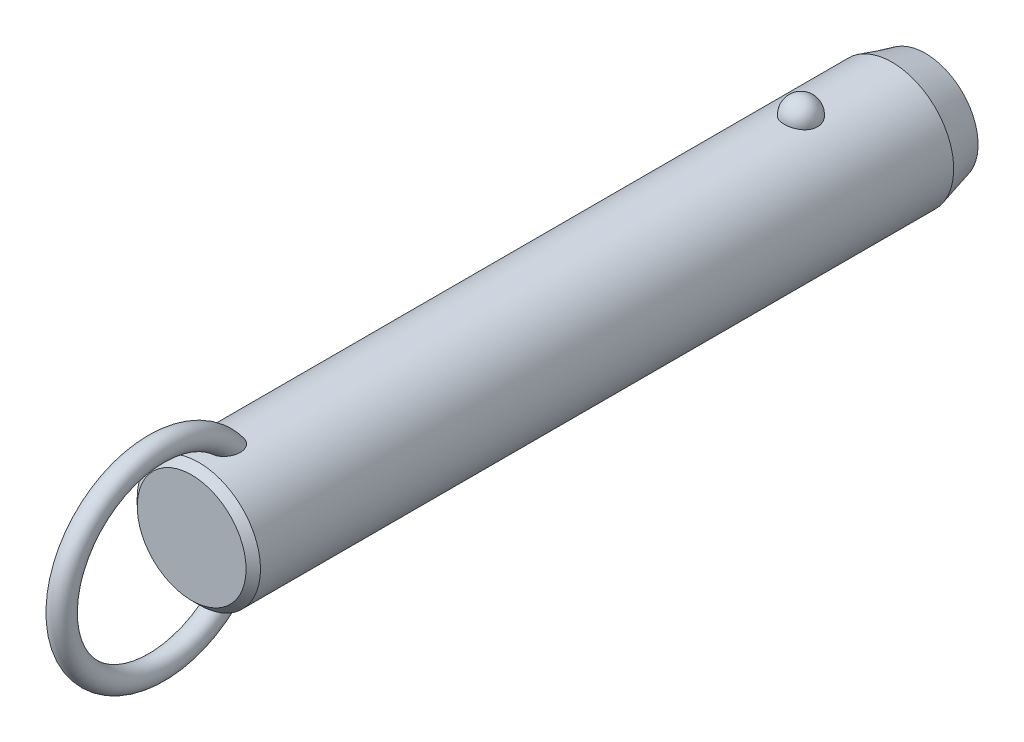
ISO-10303-21;
HEADER;
FILE_DESCRIPTION(('STEP AP214'),'2;1');
FILE_NAME('part.step','',(''),(''),'','','');
FILE_SCHEMA(('AUTOMOTIVE_DESIGN { 1 0 10303 214 1 1 1 1 }'));
ENDSEC;
DATA;
#1=APPLICATION_CONTEXT('core data for automotive mechanical design processes');
#2=APPLICATION_PROTOCOL_DEFINITION('international standard','automotive_design',2000,#1);
#3=PRODUCT_CONTEXT('',#1,'mechanical');
#4=PRODUCT('Part','Part','',(#3));
#5=PRODUCT_RELATED_PRODUCT_CATEGORY('part','',(#4));
#6=PRODUCT_DEFINITION_FORMATION('','',#4);
#7=PRODUCT_DEFINITION_CONTEXT('part definition',#1,'design');
#8=PRODUCT_DEFINITION('design','',#6,#7);
#9=PRODUCT_DEFINITION_SHAPE('','',#8);
#10=(LENGTH_UNIT() NAMED_UNIT(*) SI_UNIT(.MILLI.,.METRE.));
#11=(NAMED_UNIT(*) PLANE_ANGLE_UNIT() SI_UNIT($,.RADIAN.));
#12=(NAMED_UNIT(*) SI_UNIT($,.STERADIAN.) SOLID_ANGLE_UNIT());
#13=UNCERTAINTY_MEASURE_WITH_UNIT(LENGTH_MEASURE(1.E-05),#10,'distance_accuracy_value','');
#14=(GEOMETRIC_REPRESENTATION_CONTEXT(3) GLOBAL_UNCERTAINTY_ASSIGNED_CONTEXT((#13)) GLOBAL_UNIT_ASSIGNED_CONTEXT((#10,
#11,#12)) REPRESENTATION_CONTEXT('',''));
#15=CARTESIAN_POINT('',(0.,0.,0.));
#16=DIRECTION('',(0.,0.,1.));
#17=DIRECTION('',(1.,0.,0.));
#18=AXIS2_PLACEMENT_3D('',#15,#16,#17);
#19=CARTESIAN_POINT('',(0.,0.,94.));
#20=DIRECTION('',(0.,0.,-1.));
#21=DIRECTION('',(-1.,0.,0.));
#22=AXIS2_PLACEMENT_3D('',#19,#20,#21);
#23=CYLINDRICAL_SURFACE('',#22,11.1);
#24=CARTESIAN_POINT('',(2.9724815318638,10.6945945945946,-3.));
#25=CARTESIAN_POINT('',(2.97247830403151,10.6945972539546,-2.83225059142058));
#26=CARTESIAN_POINT('',(2.95876598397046,10.6984356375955,-2.66445972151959));
#27=CARTESIAN_POINT('',(2.90424529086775,10.7133624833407,-2.33362381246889));
#28=CARTESIAN_POINT('',(2.8634252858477,10.7244540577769,-2.1705808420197));
#29=CARTESIAN_POINT('',(2.75573657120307,10.7526272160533,-1.85396767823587));
#30=CARTESIAN_POINT('',(2.68887937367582,10.7697061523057,-1.70039333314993));
#31=CARTESIAN_POINT('',(2.53079696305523,10.8079438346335,-1.40691598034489));
#32=CARTESIAN_POINT('',(2.43957264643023,10.8291024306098,-1.2670124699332));
#33=CARTESIAN_POINT('',(2.23458150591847,10.8732541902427,-1.00409565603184));
#34=CARTESIAN_POINT('',(2.12071295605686,10.8962553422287,-0.881162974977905));
#35=CARTESIAN_POINT('',(1.87365402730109,10.9414421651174,-0.656352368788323));
#36=CARTESIAN_POINT('',(1.74046358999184,10.9636278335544,-0.554474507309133));
#37=CARTESIAN_POINT('',(1.45872188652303,11.0046495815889,-0.374872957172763));
#38=CARTESIAN_POINT('',(1.31021276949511,11.0234944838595,-0.297085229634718));
#39=CARTESIAN_POINT('',(1.00170030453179,11.0557957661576,-0.167529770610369));
#40=CARTESIAN_POINT('',(0.841698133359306,11.0692526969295,-0.115759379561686));
#41=CARTESIAN_POINT('',(0.517607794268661,11.0890932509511,-0.0403925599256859));
#42=CARTESIAN_POINT('',(0.353633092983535,11.0955916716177,-0.0163383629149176));
#43=CARTESIAN_POINT('',(0.0238420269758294,11.1011989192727,0.0044517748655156));
#44=CARTESIAN_POINT('',(-0.141974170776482,11.1003084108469,0.00119017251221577));
#45=CARTESIAN_POINT('',(-0.468405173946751,11.0912990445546,-0.0323233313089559));
#46=CARTESIAN_POINT('',(-0.629059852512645,11.0832767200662,-0.0622147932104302));
#47=CARTESIAN_POINT('',(-0.942937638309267,11.0609962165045,-0.147645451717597));
#48=CARTESIAN_POINT('',(-1.09616062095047,11.0467379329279,-0.203185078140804));
#49=CARTESIAN_POINT('',(-1.39181061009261,11.0134071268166,-0.3387529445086));
#50=CARTESIAN_POINT('',(-1.53417383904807,10.9943086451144,-0.418913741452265));
#51=CARTESIAN_POINT('',(-1.80342160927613,10.9533667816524,-0.60144882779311));
#52=CARTESIAN_POINT('',(-1.9303046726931,10.9315231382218,-0.703825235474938));
#53=CARTESIAN_POINT('',(-2.16747598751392,10.887005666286,-0.930091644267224));
#54=CARTESIAN_POINT('',(-2.27742774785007,10.8643239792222,-1.05433291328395));
#55=CARTESIAN_POINT('',(-2.47517316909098,10.8209886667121,-1.31966633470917));
#56=CARTESIAN_POINT('',(-2.56296538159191,10.8003351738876,-1.46075958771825));
#57=CARTESIAN_POINT('',(-2.71500300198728,10.7631304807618,-1.75753646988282));
#58=CARTESIAN_POINT('',(-2.77898901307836,10.7466250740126,-1.91335887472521));
#59=CARTESIAN_POINT('',(-2.88046189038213,10.7198747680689,-2.2339152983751));
#60=CARTESIAN_POINT('',(-2.91794947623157,10.709629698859,-2.39864907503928));
#61=CARTESIAN_POINT('',(-2.96537819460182,10.6965949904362,-2.73165170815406));
#62=CARTESIAN_POINT('',(-2.97542891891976,10.693775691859,-2.89990378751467));
#63=CARTESIAN_POINT('',(-2.96804271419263,10.6958279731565,-3.235752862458));
#64=CARTESIAN_POINT('',(-2.95060646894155,10.7006993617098,-3.40334987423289));
#65=CARTESIAN_POINT('',(-2.88883358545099,10.71753912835,-3.73233906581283));
#66=CARTESIAN_POINT('',(-2.84462026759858,10.7294749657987,-3.89375610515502));
#67=CARTESIAN_POINT('',(-2.73050447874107,10.7590797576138,-4.20667949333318));
#68=CARTESIAN_POINT('',(-2.66060103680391,10.7767489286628,-4.35818546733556));
#69=CARTESIAN_POINT('',(-2.49642559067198,10.8159599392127,-4.6478542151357));
#70=CARTESIAN_POINT('',(-2.40203047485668,10.8375211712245,-4.78594458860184));
#71=CARTESIAN_POINT('',(-2.19143488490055,10.8820570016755,-5.0441038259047));
#72=CARTESIAN_POINT('',(-2.07523364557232,10.9050316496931,-5.16417205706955));
#73=CARTESIAN_POINT('',(-1.82361254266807,10.9499219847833,-5.38334833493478));
#74=CARTESIAN_POINT('',(-1.68812945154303,10.9718338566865,-5.48238464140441));
#75=CARTESIAN_POINT('',(-1.40191298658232,11.0120611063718,-5.65618873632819));
#76=CARTESIAN_POINT('',(-1.25118062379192,11.0303767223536,-5.73095813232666));
#77=CARTESIAN_POINT('',(-0.940570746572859,11.0611653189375,-5.85334725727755));
#78=CARTESIAN_POINT('',(-0.780821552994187,11.0737044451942,-5.90127578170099));
#79=CARTESIAN_POINT('',(-0.455204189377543,11.0918598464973,-5.96992976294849));
#80=CARTESIAN_POINT('',(-0.289336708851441,11.0974768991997,-5.99065827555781));
#81=CARTESIAN_POINT('',(0.0406846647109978,11.1011307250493,-6.00418773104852));
#82=CARTESIAN_POINT('',(0.204817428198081,11.099299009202,-5.99747318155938));
#83=CARTESIAN_POINT('',(0.5295530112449,11.088551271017,-5.9574031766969));
#84=CARTESIAN_POINT('',(0.69015594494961,11.0796354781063,-5.92404858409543));
#85=CARTESIAN_POINT('',(1.0027760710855,11.0557204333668,-5.83180084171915));
#86=CARTESIAN_POINT('',(1.15482001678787,11.0407414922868,-5.77299291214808));
#87=CARTESIAN_POINT('',(1.44678373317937,11.0062913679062,-5.63147366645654));
#88=CARTESIAN_POINT('',(1.58670279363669,10.9868199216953,-5.54876095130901));
#89=CARTESIAN_POINT('',(1.8527023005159,10.9451315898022,-5.36027644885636));
#90=CARTESIAN_POINT('',(1.97855158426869,10.9228788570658,-5.25418644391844));
#91=CARTESIAN_POINT('',(2.21080872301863,10.8782509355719,-5.02251354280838));
#92=CARTESIAN_POINT('',(2.31721312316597,10.8558757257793,-4.89692718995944));
#93=CARTESIAN_POINT('',(2.5094551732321,10.8130715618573,-4.62745408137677));
#94=CARTESIAN_POINT('',(2.59493284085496,10.7926798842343,-4.48330448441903));
#95=CARTESIAN_POINT('',(2.740862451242,10.7565495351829,-4.18236358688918));
#96=CARTESIAN_POINT('',(2.80132490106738,10.7408089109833,-4.02557762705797));
#97=CARTESIAN_POINT('',(2.88959070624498,10.7173718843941,-3.72475308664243));
#98=CARTESIAN_POINT('',(2.92062102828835,10.7088950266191,-3.58171216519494));
#99=CARTESIAN_POINT('',(2.96206765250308,10.6975052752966,-3.29245795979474));
#100=CARTESIAN_POINT('',(2.97248434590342,10.6945922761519,-3.14624473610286));
#101=CARTESIAN_POINT('',(2.9724815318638,10.6945945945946,-3.));
#102=B_SPLINE_CURVE_WITH_KNOTS('',3,(#24,#25,#26,#27,#28,#29,#30,#31,#32,#33,#34,#35,#36,#37,
#38,#39,#40,#41,#42,#43,#44,#45,#46,#47,#48,#49,#50,#51,#52,#53,#54,#55,#56,#57,#58,#59,#60,#61,
#62,#63,#64,#65,#66,#67,#68,#69,#70,#71,#72,#73,#74,#75,#76,#77,#78,#79,#80,#81,#82,#83,#84,#85,
#86,#87,#88,#89,#90,#91,#92,#93,#94,#95,#96,#97,#98,#99,#100,#101),.UNSPECIFIED.,.T.,.F.,(4,2,2,
2,2,2,2,2,2,2,2,2,2,2,2,2,2,2,2,2,2,2,2,2,2,2,2,2,2,2,2,2,2,2,2,2,2,2,4),(0.,0.502722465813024,
1.00566079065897,1.5083769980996,2.01107471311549,2.51608392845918,3.02109467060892,
3.52475118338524,4.02835620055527,4.523518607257,5.0186364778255,5.50715297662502,
5.9956776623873,6.48688002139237,6.97812923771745,7.47814366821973,7.9781907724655,
8.48353712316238,8.9888697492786,9.49218093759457,9.99547960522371,10.4964777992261,
10.997494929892,11.5010810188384,12.0046847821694,12.5099796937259,13.0152411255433,
13.5145635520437,14.0138298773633,14.5043200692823,14.9947943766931,15.4836390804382,
15.9725123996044,16.4685040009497,16.9645836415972,17.4686765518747,17.972557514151,
18.410841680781,18.849117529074),.UNSPECIFIED.);
#103=CARTESIAN_POINT('',(2.9724815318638,10.6945945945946,-3.));
#104=VERTEX_POINT('',#103);
#105=EDGE_CURVE('E41',#104,#104,#102,.T.);
#106=ORIENTED_EDGE('',*,*,#105,.T.);
#107=EDGE_LOOP('',(#106));
#108=FACE_BOUND('',#107,.T.);
#109=CARTESIAN_POINT('',(0.,0.,105.4));
#110=DIRECTION('',(0.,0.,1.));
#111=DIRECTION('',(1.,0.,0.));
#112=AXIS2_PLACEMENT_3D('',#109,#110,#111);
#113=CIRCLE('',#112,11.1);
#114=CARTESIAN_POINT('',(11.1,0.,105.4));
#115=VERTEX_POINT('',#114);
#116=EDGE_CURVE('E10',#115,#115,#113,.F.);
#117=ORIENTED_EDGE('',*,*,#116,.T.);
#118=EDGE_LOOP('',(#117));
#119=FACE_BOUND('',#118,.T.);
#120=CARTESIAN_POINT('',(-0.564520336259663,-11.0856356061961,97.6578154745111));
#121=CARTESIAN_POINT('',(-0.667202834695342,-11.0804062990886,97.6912839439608));
#122=CARTESIAN_POINT('',(-0.766875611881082,-11.0738877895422,97.7338357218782));
#123=CARTESIAN_POINT('',(-0.957284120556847,-11.0590576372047,97.8354190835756));
#124=CARTESIAN_POINT('',(-1.04801616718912,-11.0507452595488,97.8944574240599));
#125=CARTESIAN_POINT('',(-1.21800952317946,-11.0333016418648,98.0265293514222));
#126=CARTESIAN_POINT('',(-1.29730805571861,-11.0241732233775,98.0995156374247));
#127=CARTESIAN_POINT('',(-1.44337665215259,-11.0060026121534,98.2570374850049));
#128=CARTESIAN_POINT('',(-1.51014622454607,-10.9969604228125,98.3415734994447));
#129=CARTESIAN_POINT('',(-1.63454620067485,-10.9791841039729,98.5255213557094));
#130=CARTESIAN_POINT('',(-1.69127003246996,-10.9705107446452,98.6255493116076));
#131=CARTESIAN_POINT('',(-1.78980785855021,-10.9548648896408,98.8327902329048));
#132=CARTESIAN_POINT('',(-1.83161214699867,-10.9478935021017,98.9400078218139));
#133=CARTESIAN_POINT('',(-1.91557028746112,-10.9335803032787,99.2054080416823));
#134=CARTESIAN_POINT('',(-1.95040620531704,-10.9273269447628,99.3659806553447));
#135=CARTESIAN_POINT('',(-1.99388326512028,-10.9194709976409,99.6906977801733));
#136=CARTESIAN_POINT('',(-2.00248051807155,-10.9178762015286,99.8548478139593));
#137=CARTESIAN_POINT('',(-1.99551615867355,-10.9191578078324,100.224650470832));
#138=CARTESIAN_POINT('',(-1.9732206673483,-10.9232807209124,100.430191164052));
#139=CARTESIAN_POINT('',(-1.91529761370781,-10.9335244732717,100.733595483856));
#140=CARTESIAN_POINT('',(-1.8918457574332,-10.9376266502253,100.834088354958));
#141=CARTESIAN_POINT('',(-1.83700674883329,-10.9469720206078,101.032855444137));
#142=CARTESIAN_POINT('',(-1.80562070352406,-10.9522150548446,101.131129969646));
#143=CARTESIAN_POINT('',(-1.73463055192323,-10.9636837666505,101.325914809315));
#144=CARTESIAN_POINT('',(-1.69493416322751,-10.9699202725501,101.422390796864));
#145=CARTESIAN_POINT('',(-1.60745141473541,-10.9830806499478,101.611626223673));
#146=CARTESIAN_POINT('',(-1.55966150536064,-10.9900048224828,101.704384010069));
#147=CARTESIAN_POINT('',(-1.45591812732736,-11.0042280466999,101.884690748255));
#148=CARTESIAN_POINT('',(-1.40000013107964,-11.0115253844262,101.972260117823));
#149=CARTESIAN_POINT('',(-1.27937470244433,-11.0261911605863,102.141029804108));
#150=CARTESIAN_POINT('',(-1.21467835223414,-11.0335594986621,102.22223795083));
#151=CARTESIAN_POINT('',(-1.08218150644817,-11.0473027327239,102.369001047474));
#152=CARTESIAN_POINT('',(-1.01522633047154,-11.0537063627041,102.435309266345));
#153=CARTESIAN_POINT('',(-0.87295215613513,-11.065850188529,102.558378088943));
#154=CARTESIAN_POINT('',(-0.797642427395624,-11.0715911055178,102.615149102));
#155=CARTESIAN_POINT('',(-0.651396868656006,-11.081071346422,102.707515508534));
#156=CARTESIAN_POINT('',(-0.581712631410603,-11.0849841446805,102.745049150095));
#157=CARTESIAN_POINT('',(-0.437066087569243,-11.0916271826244,102.808259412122));
#158=CARTESIAN_POINT('',(-0.362109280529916,-11.0943586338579,102.833948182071));
#159=CARTESIAN_POINT('',(-0.207828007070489,-11.0983242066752,102.871117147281));
#160=CARTESIAN_POINT('',(-0.128467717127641,-11.0995432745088,102.882454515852));
#161=CARTESIAN_POINT('',(0.0309101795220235,-11.1002423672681,102.888965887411));
#162=CARTESIAN_POINT('',(0.110927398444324,-11.0997233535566,102.884148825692));
#163=CARTESIAN_POINT('',(0.256406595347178,-11.097240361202,102.860959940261));
#164=CARTESIAN_POINT('',(0.32223577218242,-11.0955074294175,102.844754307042));
#165=CARTESIAN_POINT('',(0.450635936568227,-11.0910350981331,102.802600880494));
#166=CARTESIAN_POINT('',(0.513205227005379,-11.0882951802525,102.776648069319));
#167=CARTESIAN_POINT('',(0.662626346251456,-11.0805620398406,102.702607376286));
#168=CARTESIAN_POINT('',(0.747127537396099,-11.0751144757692,102.649845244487));
#169=CARTESIAN_POINT('',(0.906756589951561,-11.0631932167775,102.531720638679));
#170=CARTESIAN_POINT('',(0.981859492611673,-11.0567168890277,102.466325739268));
#171=CARTESIAN_POINT('',(1.10712207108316,-11.0447856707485,102.34226337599));
#172=CARTESIAN_POINT('',(1.15909566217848,-11.0394280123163,102.285383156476));
#173=CARTESIAN_POINT('',(1.25791923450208,-11.0286040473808,102.167327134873));
#174=CARTESIAN_POINT('',(1.30476642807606,-11.0231376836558,102.106149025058));
#175=CARTESIAN_POINT('',(1.43818612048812,-11.0068027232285,101.917305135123));
#176=CARTESIAN_POINT('',(1.51751767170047,-10.9960104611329,101.784453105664));
#177=CARTESIAN_POINT('',(1.63597546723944,-10.9788847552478,101.553137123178));
#178=CARTESIAN_POINT('',(1.67988876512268,-10.9722190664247,101.457053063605));
#179=CARTESIAN_POINT('',(1.75953241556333,-10.9597298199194,101.261431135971));
#180=CARTESIAN_POINT('',(1.79525967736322,-10.9539065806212,101.161891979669));
#181=CARTESIAN_POINT('',(1.85844731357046,-10.9433632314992,100.96021118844));
#182=CARTESIAN_POINT('',(1.88591073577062,-10.9386427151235,100.85807052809));
#183=CARTESIAN_POINT('',(1.93234324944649,-10.9305350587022,100.651819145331));
#184=CARTESIAN_POINT('',(1.95131065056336,-10.9271481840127,100.547708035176));
#185=CARTESIAN_POINT('',(1.99040203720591,-10.9201183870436,100.265458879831));
#186=CARTESIAN_POINT('',(2.00221217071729,-10.9179256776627,100.086037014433));
#187=CARTESIAN_POINT('',(1.99711676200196,-10.9188636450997,99.7277133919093));
#188=CARTESIAN_POINT('',(1.98026150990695,-10.9219849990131,99.548811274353));
#189=CARTESIAN_POINT('',(1.92151657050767,-10.9324473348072,99.2364514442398));
#190=CARTESIAN_POINT('',(1.88605081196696,-10.9386915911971,99.1017594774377));
#191=CARTESIAN_POINT('',(1.7939302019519,-10.9541780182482,98.8399669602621));
#192=CARTESIAN_POINT('',(1.73729868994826,-10.9634168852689,98.7128582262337));
#193=CARTESIAN_POINT('',(1.612370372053,-10.9824218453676,98.4894184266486));
#194=CARTESIAN_POINT('',(1.54715374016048,-10.9918945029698,98.3913455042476));
#195=CARTESIAN_POINT('',(1.40127026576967,-11.0114415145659,98.2074341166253));
#196=CARTESIAN_POINT('',(1.32060742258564,-11.0215157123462,98.1215924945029));
#197=CARTESIAN_POINT('',(1.14474787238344,-11.041168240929,97.9651630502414));
#198=CARTESIAN_POINT('',(1.04947805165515,-11.0507437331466,97.8946565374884));
#199=CARTESIAN_POINT('',(0.847278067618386,-11.0680789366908,97.772640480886));
#200=CARTESIAN_POINT('',(0.74035174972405,-11.0758392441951,97.7211246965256));
#201=CARTESIAN_POINT('',(0.52928931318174,-11.0878275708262,97.6434852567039));
#202=CARTESIAN_POINT('',(0.425895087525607,-11.0923259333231,97.615377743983));
#203=CARTESIAN_POINT('',(0.215723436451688,-11.0984001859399,97.5777038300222));
#204=CARTESIAN_POINT('',(0.108947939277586,-11.0999777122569,97.5681270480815));
#205=CARTESIAN_POINT('',(-0.0938962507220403,-11.1000196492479,97.5678773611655));
#206=CARTESIAN_POINT('',(-0.189967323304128,-11.0987797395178,97.5754089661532));
#207=CARTESIAN_POINT('',(-0.379657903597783,-11.0939111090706,97.6055079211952));
#208=CARTESIAN_POINT('',(-0.473277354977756,-11.0902823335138,97.6280756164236));
#209=CARTESIAN_POINT('',(-0.564520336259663,-11.0856356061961,97.6578154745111));
#210=B_SPLINE_CURVE_WITH_KNOTS('',3,(#120,#121,#122,#123,#124,#125,#126,#127,#128,#129,#130,
#131,#132,#133,#134,#135,#136,#137,#138,#139,#140,#141,#142,#143,#144,#145,#146,#147,#148,#149,
#150,#151,#152,#153,#154,#155,#156,#157,#158,#159,#160,#161,#162,#163,#164,#165,#166,#167,#168,
#169,#170,#171,#172,#173,#174,#175,#176,#177,#178,#179,#180,#181,#182,#183,#184,#185,#186,#187,
#188,#189,#190,#191,#192,#193,#194,#195,#196,#197,#198,#199,#200,#201,#202,#203,#204,#205,#206,
#207,#208,#209),.UNSPECIFIED.,.T.,.F.,(4,2,2,2,2,2,2,2,2,2,2,2,2,2,2,2,2,2,2,2,2,2,2,2,2,2,2,2,
2,2,2,2,2,2,2,2,2,2,2,2,2,2,2,2,4),(0.,0.323999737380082,0.648132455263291,0.971184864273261,
1.29424994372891,1.6388623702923,1.98369857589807,2.47426059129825,2.96564271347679,
3.58257396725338,3.89215258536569,4.20168803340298,4.51486273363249,4.82817514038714,
5.14015911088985,5.45175282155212,5.73442856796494,6.01679375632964,6.25364580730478,
6.49025437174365,6.7291996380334,6.96801276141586,7.17061258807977,7.37331685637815,
7.67094989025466,7.96935728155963,8.2007506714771,8.43226927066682,8.89581623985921,
9.21306533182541,9.53043400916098,9.84768549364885,10.1650000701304,10.70229304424,
11.2386443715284,11.6553390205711,12.0715755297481,12.4245637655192,12.7774607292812,
13.1321855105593,13.4867936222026,13.8068771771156,14.1267813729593,14.4146787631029,
14.7025827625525),.UNSPECIFIED.);
#211=CARTESIAN_POINT('',(-0.564520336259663,-11.0856356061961,97.6578154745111));
#212=VERTEX_POINT('',#211);
#213=EDGE_CURVE('E58',#212,#212,#210,.T.);
#214=ORIENTED_EDGE('',*,*,#213,.T.);
#215=EDGE_LOOP('',(#214));
#216=FACE_BOUND('',#215,.T.);
#217=CARTESIAN_POINT('',(-0.564520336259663,11.0856356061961,97.6578154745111));
#218=CARTESIAN_POINT('',(-0.468542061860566,11.0905203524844,97.6265456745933));
#219=CARTESIAN_POINT('',(-0.36979381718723,11.0942886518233,97.6031576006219));
#220=CARTESIAN_POINT('',(-0.169555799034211,11.0991586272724,97.5730858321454));
#221=CARTESIAN_POINT('',(-0.0680604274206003,11.1002543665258,97.5664393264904));
#222=CARTESIAN_POINT('',(0.134549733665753,11.099646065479,97.5701579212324));
#223=CARTESIAN_POINT('',(0.235664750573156,11.0979441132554,97.5805103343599));
#224=CARTESIAN_POINT('',(0.43463240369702,11.0919342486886,97.6178318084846));
#225=CARTESIAN_POINT('',(0.532486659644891,11.0876276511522,97.6447924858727));
#226=CARTESIAN_POINT('',(0.722445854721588,11.0768742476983,97.7144096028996));
#227=CARTESIAN_POINT('',(0.814543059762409,11.0704246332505,97.7570866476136));
#228=CARTESIAN_POINT('',(0.99056508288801,11.0560659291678,97.8566487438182));
#229=CARTESIAN_POINT('',(1.07448844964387,11.048156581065,97.9135363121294));
#230=CARTESIAN_POINT('',(1.23562672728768,11.0313221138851,98.0422106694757));
#231=CARTESIAN_POINT('',(1.31242684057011,11.0223686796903,98.1145117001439));
#232=CARTESIAN_POINT('',(1.45398030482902,11.0045918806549,98.2700425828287));
#233=CARTESIAN_POINT('',(1.51873073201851,10.9957685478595,98.3532750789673));
#234=CARTESIAN_POINT('',(1.64107232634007,10.9782087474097,98.5363842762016));
#235=CARTESIAN_POINT('',(1.69743176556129,10.9695572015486,98.6370893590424));
#236=CARTESIAN_POINT('',(1.79515063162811,10.9539887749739,98.8456264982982));
#237=CARTESIAN_POINT('',(1.83649966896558,10.9470730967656,98.9534634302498));
#238=CARTESIAN_POINT('',(1.91931148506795,10.9329211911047,99.2203995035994));
#239=CARTESIAN_POINT('',(1.95340104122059,10.9267904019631,99.3818612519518));
#240=CARTESIAN_POINT('',(1.99526195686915,10.9192174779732,99.7082163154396));
#241=CARTESIAN_POINT('',(2.00298989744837,10.9177830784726,99.8731148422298));
#242=CARTESIAN_POINT('',(1.99396251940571,10.9194420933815,100.244100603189));
#243=CARTESIAN_POINT('',(1.97050829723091,10.923774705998,100.45003871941));
#244=CARTESIAN_POINT('',(1.91079643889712,10.9343131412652,100.753901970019));
#245=CARTESIAN_POINT('',(1.88673702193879,10.9385106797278,100.854529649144));
#246=CARTESIAN_POINT('',(1.83065508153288,10.9480376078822,101.053510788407));
#247=CARTESIAN_POINT('',(1.79863369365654,10.9533668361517,101.151864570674));
#248=CARTESIAN_POINT('',(1.72633365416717,10.9649954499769,101.346720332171));
#249=CARTESIAN_POINT('',(1.68596409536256,10.9713053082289,101.44318790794));
#250=CARTESIAN_POINT('',(1.59707998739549,10.9845964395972,101.632323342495));
#251=CARTESIAN_POINT('',(1.54856169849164,10.9915780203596,101.724989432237));
#252=CARTESIAN_POINT('',(1.44330168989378,11.0058935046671,101.904975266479));
#253=CARTESIAN_POINT('',(1.38659749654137,11.0132257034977,101.992316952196));
#254=CARTESIAN_POINT('',(1.26431158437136,11.0279330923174,102.160456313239));
#255=CARTESIAN_POINT('',(1.19874160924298,11.0353082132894,102.241262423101));
#256=CARTESIAN_POINT('',(1.06542088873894,11.048931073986,102.385985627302));
#257=CARTESIAN_POINT('',(0.998640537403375,11.0552153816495,102.450784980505));
#258=CARTESIAN_POINT('',(0.856896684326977,11.0671032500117,102.570846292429));
#259=CARTESIAN_POINT('',(0.781942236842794,11.0727075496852,102.626118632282));
#260=CARTESIAN_POINT('',(0.636276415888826,11.081949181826,102.715972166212));
#261=CARTESIAN_POINT('',(0.566755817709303,11.0857572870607,102.752441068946));
#262=CARTESIAN_POINT('',(0.422602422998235,11.0921860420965,102.813533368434));
#263=CARTESIAN_POINT('',(0.347974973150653,11.0948079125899,102.838168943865));
#264=CARTESIAN_POINT('',(0.194593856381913,11.0985608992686,102.873323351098));
#265=CARTESIAN_POINT('',(0.115807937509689,11.0996777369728,102.883706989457));
#266=CARTESIAN_POINT('',(-0.0422499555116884,11.1002003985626,102.888574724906));
#267=CARTESIAN_POINT('',(-0.121521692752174,11.09960699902,102.883066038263));
#268=CARTESIAN_POINT('',(-0.266046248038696,11.0970123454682,102.858827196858));
#269=CARTESIAN_POINT('',(-0.331661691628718,11.0952283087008,102.842135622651));
#270=CARTESIAN_POINT('',(-0.459588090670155,11.0906663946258,102.799111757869));
#271=CARTESIAN_POINT('',(-0.521897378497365,11.0878880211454,102.772774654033));
#272=CARTESIAN_POINT('',(-0.671446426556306,11.0800342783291,102.697513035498));
#273=CARTESIAN_POINT('',(-0.756250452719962,11.0744969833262,102.643818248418));
#274=CARTESIAN_POINT('',(-0.916349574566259,11.0624045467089,102.523802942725));
#275=CARTESIAN_POINT('',(-0.99161892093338,11.0558467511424,102.457449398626));
#276=CARTESIAN_POINT('',(-1.11713140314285,11.0437783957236,102.331633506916));
#277=CARTESIAN_POINT('',(-1.16920539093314,11.0383619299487,102.273952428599));
#278=CARTESIAN_POINT('',(-1.26817476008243,11.02743010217,102.154280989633));
#279=CARTESIAN_POINT('',(-1.31506731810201,11.0219146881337,102.092288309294));
#280=CARTESIAN_POINT('',(-1.40399813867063,11.0109399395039,101.964784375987));
#281=CARTESIAN_POINT('',(-1.4460286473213,11.0054807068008,101.899267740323));
#282=CARTESIAN_POINT('',(-1.52538779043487,10.9947621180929,101.765422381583));
#283=CARTESIAN_POINT('',(-1.56271516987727,10.9895028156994,101.697092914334));
#284=CARTESIAN_POINT('',(-1.64537943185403,10.9774790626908,101.533210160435));
#285=CARTESIAN_POINT('',(-1.68879497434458,10.9708503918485,101.4366735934));
#286=CARTESIAN_POINT('',(-1.76740738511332,10.9584602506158,101.240236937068));
#287=CARTESIAN_POINT('',(-1.80260120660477,10.95269910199,101.14033561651));
#288=CARTESIAN_POINT('',(-1.86468657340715,10.9423003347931,100.937966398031));
#289=CARTESIAN_POINT('',(-1.89158164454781,10.9376622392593,100.835499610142));
#290=CARTESIAN_POINT('',(-1.93682458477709,10.9297405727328,100.628642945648));
#291=CARTESIAN_POINT('',(-1.9551708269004,10.9264572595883,100.524252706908));
#292=CARTESIAN_POINT('',(-1.99232562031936,10.9197647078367,100.24262876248));
#293=CARTESIAN_POINT('',(-2.00294603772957,10.9177914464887,100.064185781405));
#294=CARTESIAN_POINT('',(-1.99566675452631,10.9191290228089,99.7079962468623));
#295=CARTESIAN_POINT('',(-1.97781651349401,10.9224306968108,99.5302490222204));
#296=CARTESIAN_POINT('',(-1.91747214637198,10.9331592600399,99.2197921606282));
#297=CARTESIAN_POINT('',(-1.88131022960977,10.9395108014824,99.085825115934));
#298=CARTESIAN_POINT('',(-1.7879038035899,10.9551659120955,98.8255975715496));
#299=CARTESIAN_POINT('',(-1.7306830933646,10.9644661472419,98.6993285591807));
#300=CARTESIAN_POINT('',(-1.60475573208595,10.9835398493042,98.4774156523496));
#301=CARTESIAN_POINT('',(-1.53908879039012,10.9930297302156,98.3800265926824));
#302=CARTESIAN_POINT('',(-1.39238608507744,11.0125708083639,98.1975250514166));
#303=CARTESIAN_POINT('',(-1.31135150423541,11.0226219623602,98.1124116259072));
#304=CARTESIAN_POINT('',(-1.14382035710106,11.0411991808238,97.9652994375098));
#305=CARTESIAN_POINT('',(-1.05858500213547,11.0497792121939,97.9018693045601));
#306=CARTESIAN_POINT('',(-0.878723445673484,11.0655285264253,97.7902505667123));
#307=CARTESIAN_POINT('',(-0.784123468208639,11.0727015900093,97.7420208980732));
#308=CARTESIAN_POINT('',(-0.646163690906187,11.0812501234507,97.686023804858));
#309=CARTESIAN_POINT('',(-0.605595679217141,11.0835451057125,97.6711978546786));
#310=CARTESIAN_POINT('',(-0.564520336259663,11.0856356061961,97.6578154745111));
#311=B_SPLINE_CURVE_WITH_KNOTS('',3,(#217,#218,#219,#220,#221,#222,#223,#224,#225,#226,#227,
#228,#229,#230,#231,#232,#233,#234,#235,#236,#237,#238,#239,#240,#241,#242,#243,#244,#245,#246,
#247,#248,#249,#250,#251,#252,#253,#254,#255,#256,#257,#258,#259,#260,#261,#262,#263,#264,#265,
#266,#267,#268,#269,#270,#271,#272,#273,#274,#275,#276,#277,#278,#279,#280,#281,#282,#283,#284,
#285,#286,#287,#288,#289,#290,#291,#292,#293,#294,#295,#296,#297,#298,#299,#300,#301,#302,#303,
#304,#305,#306,#307,#308,#309,#310),.UNSPECIFIED.,.T.,.F.,(4,2,2,2,2,2,2,2,2,2,2,2,2,2,2,2,2,2,
2,2,2,2,2,2,2,2,2,2,2,2,2,2,2,2,2,2,2,2,2,2,2,2,2,2,2,2,4),(0.,0.303061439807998,
0.606795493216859,0.910302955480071,1.21365733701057,1.51741085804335,1.82121821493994,
2.13745205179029,2.45376252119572,2.79958678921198,3.14564996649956,3.6383239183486,
4.13180893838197,4.75031912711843,5.06071926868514,5.37107516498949,5.68500772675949,
5.99908475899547,6.31176519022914,6.62403542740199,6.90315673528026,7.1819719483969,
7.41687778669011,7.65154134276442,7.88841587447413,8.12518286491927,8.3275284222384,
8.52997509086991,8.82986421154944,9.13054668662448,9.36393502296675,9.59744991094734,
9.83133221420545,10.0652767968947,10.383032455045,10.7009056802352,11.0186436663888,
11.3364420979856,11.8705925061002,12.4038159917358,12.8189662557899,13.2336487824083,
13.5857049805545,13.9377340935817,14.2561354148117,14.5736690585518,14.7033687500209),.UNSPECIFIED.);
#312=CARTESIAN_POINT('',(-0.564520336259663,11.0856356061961,97.6578154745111));
#313=VERTEX_POINT('',#312);
#314=EDGE_CURVE('E66',#313,#313,#311,.T.);
#315=ORIENTED_EDGE('',*,*,#314,.T.);
#316=EDGE_LOOP('',(#315));
#317=FACE_BOUND('',#316,.T.);
#318=CARTESIAN_POINT('',(0.,0.,-19.3999999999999));
#319=DIRECTION('',(0.,0.,-1.));
#320=DIRECTION('',(-1.,0.,0.));
#321=AXIS2_PLACEMENT_3D('',#318,#319,#320);
#322=CIRCLE('',#321,11.1);
#323=CARTESIAN_POINT('',(-11.1,0.,-19.3999999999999));
#324=VERTEX_POINT('',#323);
#325=EDGE_CURVE('E55',#324,#324,#322,.F.);
#326=ORIENTED_EDGE('',*,*,#325,.T.);
#327=EDGE_LOOP('',(#326));
#328=FACE_BOUND('',#327,.T.);
#329=ADVANCED_FACE('F37',(#108,#119,#216,#317,#328),#23,.T.);
#330=CARTESIAN_POINT('',(0.,0.,-25.4));
#331=DIRECTION('',(0.,0.,-1.));
#332=DIRECTION('',(-1.,0.,0.));
#333=AXIS2_PLACEMENT_3D('',#330,#331,#332);
#334=PLANE('',#333);
#335=CARTESIAN_POINT('',(0.,0.,-25.4));
#336=DIRECTION('',(0.,0.,-1.));
#337=DIRECTION('',(-1.,0.,0.));
#338=AXIS2_PLACEMENT_3D('',#335,#336,#337);
#339=CIRCLE('',#338,9.49230484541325);
#340=CARTESIAN_POINT('',(-9.49230484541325,0.,-25.4));
#341=VERTEX_POINT('',#340);
#342=EDGE_CURVE('E65',#341,#341,#339,.T.);
#343=ORIENTED_EDGE('',*,*,#342,.T.);
#344=EDGE_LOOP('',(#343));
#345=FACE_BOUND('',#344,.T.);
#346=ADVANCED_FACE('F84',(#345),#334,.T.);
#347=CARTESIAN_POINT('',(0.,0.,-25.4));
#348=DIRECTION('',(0.,0.,1.));
#349=DIRECTION('',(1.,0.,0.));
#350=AXIS2_PLACEMENT_3D('',#347,#348,#349);
#351=CONICAL_SURFACE('',#350,9.49230484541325,0.261799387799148);
#352=ORIENTED_EDGE('',*,*,#325,.F.);
#353=EDGE_LOOP('',(#352));
#354=FACE_BOUND('',#353,.T.);
#355=ORIENTED_EDGE('',*,*,#342,.F.);
#356=EDGE_LOOP('',(#355));
#357=FACE_BOUND('',#356,.T.);
#358=ADVANCED_FACE('F82',(#354,#357),#351,.T.);
#359=CARTESIAN_POINT('',(0.,0.,106.7));
#360=DIRECTION('',(0.,0.,1.));
#361=DIRECTION('',(1.,0.,0.));
#362=AXIS2_PLACEMENT_3D('',#359,#360,#361);
#363=PLANE('',#362);
#364=CARTESIAN_POINT('',(0.,0.,106.7));
#365=DIRECTION('',(0.,0.,1.));
#366=DIRECTION('',(1.,0.,0.));
#367=AXIS2_PLACEMENT_3D('',#364,#365,#366);
#368=CIRCLE('',#367,9.79999999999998);
#369=CARTESIAN_POINT('',(9.79999999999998,0.,106.7));
#370=VERTEX_POINT('',#369);
#371=EDGE_CURVE('E50',#370,#370,#368,.T.);
#372=ORIENTED_EDGE('',*,*,#371,.T.);
#373=EDGE_LOOP('',(#372));
#374=FACE_BOUND('',#373,.T.);
#375=ADVANCED_FACE('F76',(#374),#363,.T.);
#376=CARTESIAN_POINT('',(0.,0.,113.05));
#377=DIRECTION('',(1.,0.,0.));
#378=DIRECTION('',(0.,0.,-1.));
#379=AXIS2_PLACEMENT_3D('',#376,#377,#378);
#380=TOROIDAL_SURFACE('',#379,17.05,2.);
#381=ORIENTED_EDGE('',*,*,#314,.F.);
#382=EDGE_LOOP('',(#381));
#383=FACE_BOUND('',#382,.T.);
#384=ORIENTED_EDGE('',*,*,#213,.F.);
#385=EDGE_LOOP('',(#384));
#386=FACE_BOUND('',#385,.T.);
#387=ADVANCED_FACE('F72',(#383,#386),#380,.T.);
#388=CARTESIAN_POINT('',(0.,0.,106.7));
#389=DIRECTION('',(0.,0.,-1.));
#390=DIRECTION('',(-1.,0.,0.));
#391=AXIS2_PLACEMENT_3D('',#388,#389,#390);
#392=CONICAL_SURFACE('',#391,9.79999999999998,0.785398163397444);
#393=ORIENTED_EDGE('',*,*,#116,.F.);
#394=EDGE_LOOP('',(#393));
#395=FACE_BOUND('',#394,.T.);
#396=ORIENTED_EDGE('',*,*,#371,.F.);
#397=EDGE_LOOP('',(#396));
#398=FACE_BOUND('',#397,.T.);
#399=ADVANCED_FACE('F39',(#395,#398),#392,.T.);
#400=CARTESIAN_POINT('',(0.,11.1,-3.));
#401=DIRECTION('',(0.,1.,0.));
#402=DIRECTION('',(0.,0.,-1.));
#403=AXIS2_PLACEMENT_3D('',#400,#401,#402);
#404=SPHERICAL_SURFACE('',#403,3.);
#405=ORIENTED_EDGE('',*,*,#105,.F.);
#406=EDGE_LOOP('',(#405));
#407=FACE_BOUND('',#406,.T.);
#408=ADVANCED_FACE('F78',(#407),#404,.T.);
#409=CLOSED_SHELL('',(#329,#346,#358,#375,#387,#399,#408));
#410=MANIFOLD_SOLID_BREP('B2',#409);
#411=ADVANCED_BREP_SHAPE_REPRESENTATION('',(#18,#410),#14);
#412=SHAPE_DEFINITION_REPRESENTATION(#9,#411);
ENDSEC;
END-ISO-10303-21;
